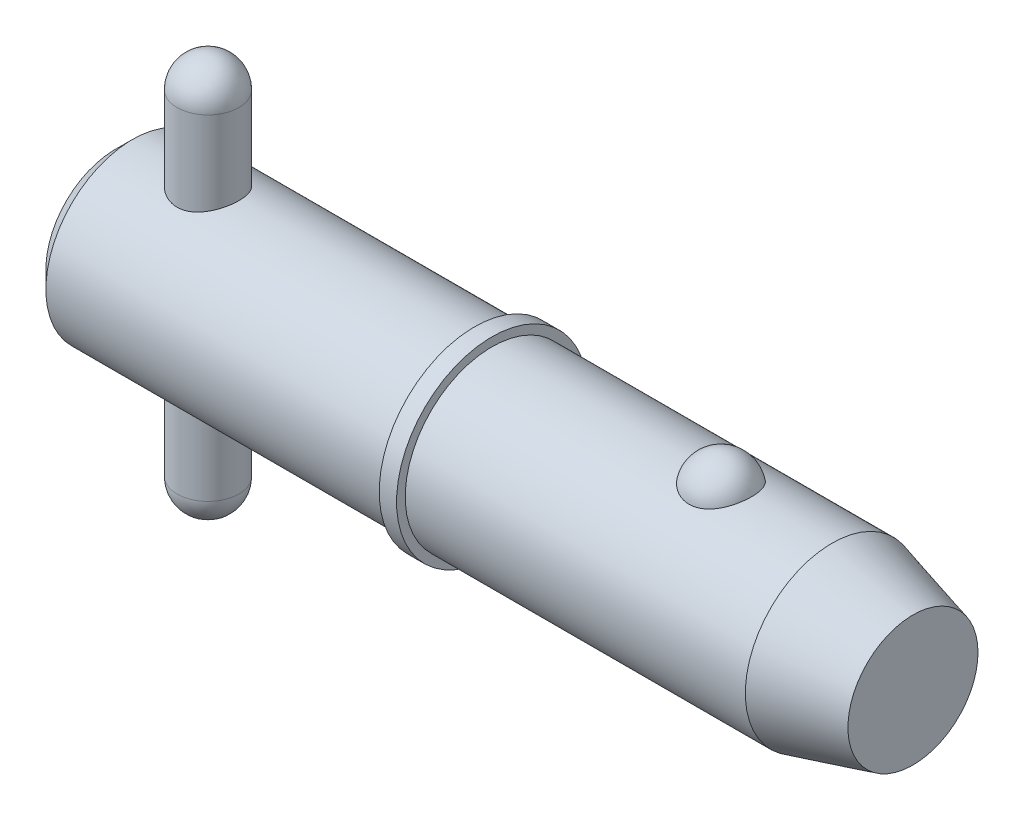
ISO-10303-21;
HEADER;
FILE_DESCRIPTION(('STEP AP214'),'2;1');
FILE_NAME('part.step','',(''),(''),'','','');
FILE_SCHEMA(('AUTOMOTIVE_DESIGN { 1 0 10303 214 1 1 1 1 }'));
ENDSEC;
DATA;
#1=APPLICATION_CONTEXT('core data for automotive mechanical design processes');
#2=APPLICATION_PROTOCOL_DEFINITION('international standard','automotive_design',2000,#1);
#3=PRODUCT_CONTEXT('',#1,'mechanical');
#4=PRODUCT('Part','Part','',(#3));
#5=PRODUCT_RELATED_PRODUCT_CATEGORY('part','',(#4));
#6=PRODUCT_DEFINITION_FORMATION('','',#4);
#7=PRODUCT_DEFINITION_CONTEXT('part definition',#1,'design');
#8=PRODUCT_DEFINITION('design','',#6,#7);
#9=PRODUCT_DEFINITION_SHAPE('','',#8);
#10=(LENGTH_UNIT() NAMED_UNIT(*) SI_UNIT(.MILLI.,.METRE.));
#11=(NAMED_UNIT(*) PLANE_ANGLE_UNIT() SI_UNIT($,.RADIAN.));
#12=(NAMED_UNIT(*) SI_UNIT($,.STERADIAN.) SOLID_ANGLE_UNIT());
#13=UNCERTAINTY_MEASURE_WITH_UNIT(LENGTH_MEASURE(1.E-05),#10,'distance_accuracy_value','');
#14=(GEOMETRIC_REPRESENTATION_CONTEXT(3) GLOBAL_UNCERTAINTY_ASSIGNED_CONTEXT((#13)) GLOBAL_UNIT_ASSIGNED_CONTEXT((#10,
#11,#12)) REPRESENTATION_CONTEXT('',''));
#15=CARTESIAN_POINT('',(0.,0.,0.));
#16=DIRECTION('',(0.,0.,1.));
#17=DIRECTION('',(1.,0.,0.));
#18=AXIS2_PLACEMENT_3D('',#15,#16,#17);
#19=CARTESIAN_POINT('',(5.94,12.7,0.));
#20=DIRECTION('',(0.,-1.,0.));
#21=DIRECTION('',(0.,0.,-1.));
#22=AXIS2_PLACEMENT_3D('',#19,#20,#21);
#23=CYLINDRICAL_SURFACE('',#22,1.98);
#24=CARTESIAN_POINT('',(5.94,-10.72,0.));
#25=DIRECTION('',(0.,-1.,0.));
#26=DIRECTION('',(0.,0.,-1.));
#27=AXIS2_PLACEMENT_3D('',#24,#25,#26);
#28=CIRCLE('',#27,1.98);
#29=CARTESIAN_POINT('',(5.94,-10.72,-1.98));
#30=VERTEX_POINT('',#29);
#31=EDGE_CURVE('P0_E10',#30,#30,#28,.F.);
#32=ORIENTED_EDGE('',*,*,#31,.T.);
#33=EDGE_LOOP('',(#32));
#34=FACE_BOUND('',#33,.T.);
#35=CARTESIAN_POINT('',(5.94,10.72,0.));
#36=DIRECTION('',(0.,-1.,0.));
#37=DIRECTION('',(0.,0.,-1.));
#38=AXIS2_PLACEMENT_3D('',#35,#36,#37);
#39=CIRCLE('',#38,1.98);
#40=CARTESIAN_POINT('',(5.94,10.72,-1.98));
#41=VERTEX_POINT('',#40);
#42=EDGE_CURVE('P0_E21',#41,#41,#39,.T.);
#43=ORIENTED_EDGE('',*,*,#42,.T.);
#44=EDGE_LOOP('',(#43));
#45=FACE_BOUND('',#44,.T.);
#46=ADVANCED_FACE('P0_F14',(#34,#45),#23,.T.);
#47=CARTESIAN_POINT('',(5.94,-10.72,0.));
#48=DIRECTION('',(0.,0.,1.));
#49=DIRECTION('',(1.,0.,0.));
#50=AXIS2_PLACEMENT_3D('',#47,#48,#49);
#51=SPHERICAL_SURFACE('',#50,1.98);
#52=CARTESIAN_POINT('',(5.94,-10.72,0.));
#53=DIRECTION('',(0.,-1.,0.));
#54=DIRECTION('',(0.,0.,-1.));
#55=AXIS2_PLACEMENT_3D('',#52,#53,#54);
#56=SPHERICAL_SURFACE('',#55,1.98);
#57=ORIENTED_EDGE('',*,*,#31,.F.);
#58=EDGE_LOOP('',(#57));
#59=FACE_BOUND('',#58,.T.);
#60=ADVANCED_FACE('P0_F29',(#59),#56,.T.);
#61=CARTESIAN_POINT('',(5.94,10.72,0.));
#62=DIRECTION('',(0.,0.,1.));
#63=DIRECTION('',(1.,0.,0.));
#64=AXIS2_PLACEMENT_3D('',#61,#62,#63);
#65=SPHERICAL_SURFACE('',#64,1.98);
#66=CARTESIAN_POINT('',(5.94,10.72,0.));
#67=DIRECTION('',(0.,-1.,0.));
#68=DIRECTION('',(0.,0.,-1.));
#69=AXIS2_PLACEMENT_3D('',#66,#67,#68);
#70=SPHERICAL_SURFACE('',#69,1.98);
#71=ORIENTED_EDGE('',*,*,#42,.F.);
#72=EDGE_LOOP('',(#71));
#73=FACE_BOUND('',#72,.T.);
#74=ADVANCED_FACE('P0_F16',(#73),#70,.T.);
#75=CLOSED_SHELL('',(#46,#60,#74));
#76=MANIFOLD_SOLID_BREP('P0_B1',#75);
#77=CARTESIAN_POINT('',(0.,0.,0.));
#78=DIRECTION('',(1.,0.,0.));
#79=DIRECTION('',(0.,0.,-1.));
#80=AXIS2_PLACEMENT_3D('',#77,#78,#79);
#81=CYLINDRICAL_SURFACE('',#80,5.555);
#82=CARTESIAN_POINT('',(45.9171144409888,0.,0.));
#83=DIRECTION('',(1.,0.,0.));
#84=DIRECTION('',(0.,0.,-1.));
#85=AXIS2_PLACEMENT_3D('',#82,#83,#84);
#86=CIRCLE('',#85,5.555);
#87=CARTESIAN_POINT('',(45.9171144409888,0.,-5.555));
#88=VERTEX_POINT('',#87);
#89=EDGE_CURVE('P1_E81',#88,#88,#86,.T.);
#90=ORIENTED_EDGE('',*,*,#89,.F.);
#91=EDGE_LOOP('',(#90));
#92=FACE_BOUND('',#91,.T.);
#93=CARTESIAN_POINT('',(24.13,0.,0.));
#94=DIRECTION('',(1.,0.,0.));
#95=DIRECTION('',(0.,0.,-1.));
#96=AXIS2_PLACEMENT_3D('',#93,#94,#95);
#97=CIRCLE('',#96,5.555);
#98=CARTESIAN_POINT('',(24.13,0.,-5.555));
#99=VERTEX_POINT('',#98);
#100=EDGE_CURVE('P1_E85',#99,#99,#97,.T.);
#101=ORIENTED_EDGE('',*,*,#100,.T.);
#102=EDGE_LOOP('',(#101));
#103=FACE_BOUND('',#102,.T.);
#104=CARTESIAN_POINT('',(38.7986264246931,5.16741224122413,2.03859650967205));
#105=CARTESIAN_POINT('',(38.6929492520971,5.16740893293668,2.03859990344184));
#106=CARTESIAN_POINT('',(38.58729894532,5.17079470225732,2.03008306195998));
#107=CARTESIAN_POINT('',(38.3791419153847,5.18392795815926,1.9963072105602));
#108=CARTESIAN_POINT('',(38.2766344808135,5.19367399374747,1.9710520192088));
#109=CARTESIAN_POINT('',(38.0777710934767,5.21839168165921,1.90463997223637));
#110=CARTESIAN_POINT('',(37.9814064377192,5.23335573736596,1.86350622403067));
#111=CARTESIAN_POINT('',(37.7970804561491,5.26688076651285,1.76652592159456));
#112=CARTESIAN_POINT('',(37.7091207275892,5.28544242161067,1.71067657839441));
#113=CARTESIAN_POINT('',(37.5412654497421,5.32479845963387,1.58399959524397));
#114=CARTESIAN_POINT('',(37.4616656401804,5.34564089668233,1.51279545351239));
#115=CARTESIAN_POINT('',(37.3151290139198,5.38697258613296,1.35828584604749));
#116=CARTESIAN_POINT('',(37.248194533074,5.40746177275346,1.27497815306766));
#117=CARTESIAN_POINT('',(37.1256103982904,5.44694508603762,1.09440293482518));
#118=CARTESIAN_POINT('',(37.0705989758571,5.46583143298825,0.99667783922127));
#119=CARTESIAN_POINT('',(36.9769376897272,5.49908030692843,0.792961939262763));
#120=CARTESIAN_POINT('',(36.9382894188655,5.513442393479,0.686970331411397));
#121=CARTESIAN_POINT('',(36.8776807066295,5.536358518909,0.468019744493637));
#122=CARTESIAN_POINT('',(36.8559725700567,5.54482455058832,0.35498154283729));
#123=CARTESIAN_POINT('',(36.8306362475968,5.55473324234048,0.126595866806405));
#124=CARTESIAN_POINT('',(36.8270077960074,5.55617600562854,0.0112484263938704));
#125=CARTESIAN_POINT('',(36.8378817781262,5.55189984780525,-0.21801161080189));
#126=CARTESIAN_POINT('',(36.8523151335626,5.54620821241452,-0.331928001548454));
#127=CARTESIAN_POINT('',(36.898903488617,5.52828920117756,-0.555544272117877));
#128=CARTESIAN_POINT('',(36.9310588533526,5.5160616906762,-0.665244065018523));
#129=CARTESIAN_POINT('',(37.0124883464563,5.48630779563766,-0.877469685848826));
#130=CARTESIAN_POINT('',(37.0617816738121,5.4687754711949,-0.979987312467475));
#131=CARTESIAN_POINT('',(37.1764785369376,5.43024700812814,-1.1748697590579));
#132=CARTESIAN_POINT('',(37.2418831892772,5.4092506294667,-1.26723387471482));
#133=CARTESIAN_POINT('',(37.3875712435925,5.36600927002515,-1.4394013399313));
#134=CARTESIAN_POINT('',(37.4678859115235,5.34376173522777,-1.51917763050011));
#135=CARTESIAN_POINT('',(37.6414520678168,5.30057971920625,-1.6636033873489));
#136=CARTESIAN_POINT('',(37.734702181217,5.27964509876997,-1.72825445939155));
#137=CARTESIAN_POINT('',(37.9293939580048,5.24205250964,-1.8390947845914));
#138=CARTESIAN_POINT('',(38.0305900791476,5.22530519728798,-1.88568407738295));
#139=CARTESIAN_POINT('',(38.2401552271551,5.19750919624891,-1.96100802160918));
#140=CARTESIAN_POINT('',(38.3485215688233,5.1864583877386,-1.98974931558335));
#141=CARTESIAN_POINT('',(38.5634989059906,5.17184410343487,-2.02742262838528));
#142=CARTESIAN_POINT('',(38.669925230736,5.16793282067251,-2.0372760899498));
#143=CARTESIAN_POINT('',(38.8829925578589,5.1669899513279,-2.03966777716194));
#144=CARTESIAN_POINT('',(38.9896335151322,5.16995704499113,-2.03220932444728));
#145=CARTESIAN_POINT('',(39.1967730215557,5.18222383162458,-2.0007117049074));
#146=CARTESIAN_POINT('',(39.2973599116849,5.19133213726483,-1.97717337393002));
#147=CARTESIAN_POINT('',(39.4930141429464,5.21467637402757,-1.91475248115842));
#148=CARTESIAN_POINT('',(39.5880810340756,5.22891272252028,-1.87586867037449));
#149=CARTESIAN_POINT('',(39.7723711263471,5.26137066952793,-1.78282713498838));
#150=CARTESIAN_POINT('',(39.8614190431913,5.27967329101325,-1.7283512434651));
#151=CARTESIAN_POINT('',(40.0292880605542,5.31817411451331,-1.60597483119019));
#152=CARTESIAN_POINT('',(40.1081068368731,5.33837274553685,-1.53807126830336));
#153=CARTESIAN_POINT('',(40.2575156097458,5.37968287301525,-1.38688970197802));
#154=CARTESIAN_POINT('',(40.3275058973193,5.40079011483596,-1.30301744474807));
#155=CARTESIAN_POINT('',(40.4530125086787,5.44074401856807,-1.12458170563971));
#156=CARTESIAN_POINT('',(40.5085262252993,5.4595902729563,-1.03001630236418));
#157=CARTESIAN_POINT('',(40.6055507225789,5.49369849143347,-0.829439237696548));
#158=CARTESIAN_POINT('',(40.6465483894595,5.50882422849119,-0.723155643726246));
#159=CARTESIAN_POINT('',(40.7111250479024,5.53310911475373,-0.50477271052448));
#160=CARTESIAN_POINT('',(40.7347036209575,5.54226812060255,-0.3926732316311));
#161=CARTESIAN_POINT('',(40.764013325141,5.55370358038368,-0.165459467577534));
#162=CARTESIAN_POINT('',(40.7696884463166,5.55595843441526,-0.0503368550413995));
#163=CARTESIAN_POINT('',(40.762916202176,5.55329317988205,0.179288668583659));
#164=CARTESIAN_POINT('',(40.7504690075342,5.54837313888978,0.293791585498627));
#165=CARTESIAN_POINT('',(40.7077798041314,5.53189037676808,0.518526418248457));
#166=CARTESIAN_POINT('',(40.677598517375,5.5203503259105,0.628771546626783));
#167=CARTESIAN_POINT('',(40.6000962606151,5.49182453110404,0.842318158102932));
#168=CARTESIAN_POINT('',(40.5527743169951,5.47483847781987,0.945619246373));
#169=CARTESIAN_POINT('',(40.4417204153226,5.43710633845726,1.14281571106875));
#170=CARTESIAN_POINT('',(40.3779215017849,5.41634501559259,1.23667048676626));
#171=CARTESIAN_POINT('',(40.2353577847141,5.37334572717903,1.4118524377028));
#172=CARTESIAN_POINT('',(40.1565932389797,5.35110778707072,1.49317982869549));
#173=CARTESIAN_POINT('',(39.9864234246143,5.30779474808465,1.64049162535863));
#174=CARTESIAN_POINT('',(39.8951002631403,5.28671324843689,1.7065687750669));
#175=CARTESIAN_POINT('',(39.7017390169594,5.24804852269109,1.82201372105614));
#176=CARTESIAN_POINT('',(39.5997005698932,5.23046541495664,1.87138095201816));
#177=CARTESIAN_POINT('',(39.3836187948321,5.20042692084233,1.95335298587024));
#178=CARTESIAN_POINT('',(39.269260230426,5.18820192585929,1.98521734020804));
#179=CARTESIAN_POINT('',(39.0361307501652,5.17169804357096,2.02783294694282));
#180=CARTESIAN_POINT('',(38.9173616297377,5.16741595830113,2.03859269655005));
#181=CARTESIAN_POINT('',(38.7986264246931,5.16741224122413,2.03859650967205));
#182=B_SPLINE_CURVE_WITH_KNOTS('',3,(#104,#105,#106,#107,#108,#109,#110,#111,#112,#113,#114,
#115,#116,#117,#118,#119,#120,#121,#122,#123,#124,#125,#126,#127,#128,#129,#130,#131,#132,#133,
#134,#135,#136,#137,#138,#139,#140,#141,#142,#143,#144,#145,#146,#147,#148,#149,#150,#151,#152,
#153,#154,#155,#156,#157,#158,#159,#160,#161,#162,#163,#164,#165,#166,#167,#168,#169,#170,#171,
#172,#173,#174,#175,#176,#177,#178,#179,#180,#181),.UNSPECIFIED.,.T.,.F.,(4,2,2,2,2,2,2,2,2,2,2,
2,2,2,2,2,2,2,2,2,2,2,2,2,2,2,2,2,2,2,2,2,2,2,2,2,2,2,4),(0.,0.316595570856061,
0.633118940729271,0.949183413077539,1.26530783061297,1.59030762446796,1.91536729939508,
2.25495824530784,2.59458224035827,2.93917283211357,3.28375835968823,3.62703002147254,
3.97030875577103,4.31397329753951,4.65766166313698,5.00207904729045,5.34645984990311,
5.6827054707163,6.01882587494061,6.33808403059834,6.65728093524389,6.9669637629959,
7.27667180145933,7.59321535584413,7.90983070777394,8.24210387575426,8.57443684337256,
8.91755896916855,9.26068933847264,9.60489211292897,9.94909164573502,10.2921194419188,
10.6351667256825,10.9796305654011,11.324088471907,11.666392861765,12.0087088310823,
12.3645679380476,12.7202837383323),.UNSPECIFIED.);
#183=CARTESIAN_POINT('',(38.7986264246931,5.16741224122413,2.03859650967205));
#184=VERTEX_POINT('',#183);
#185=EDGE_CURVE('P1_E35',#184,#184,#182,.T.);
#186=ORIENTED_EDGE('',*,*,#185,.T.);
#187=EDGE_LOOP('',(#186));
#188=FACE_BOUND('',#187,.T.);
#189=ADVANCED_FACE('P1_F13',(#92,#103,#188),#81,.T.);
#190=CARTESIAN_POINT('',(0.,0.,0.));
#191=DIRECTION('',(-1.,0.,0.));
#192=DIRECTION('',(0.,0.,1.));
#193=AXIS2_PLACEMENT_3D('',#190,#191,#192);
#194=PLANE('',#193);
#195=CARTESIAN_POINT('',(0.,0.,0.));
#196=DIRECTION('',(1.,0.,0.));
#197=DIRECTION('',(0.,0.,-1.));
#198=AXIS2_PLACEMENT_3D('',#195,#196,#197);
#199=CIRCLE('',#198,4.444);
#200=CARTESIAN_POINT('',(0.,0.,-4.444));
#201=VERTEX_POINT('',#200);
#202=EDGE_CURVE('P1_E9',#201,#201,#199,.T.);
#203=ORIENTED_EDGE('',*,*,#202,.F.);
#204=EDGE_LOOP('',(#203));
#205=FACE_BOUND('',#204,.T.);
#206=ADVANCED_FACE('P1_F15',(#205),#194,.T.);
#207=CARTESIAN_POINT('',(1.111,0.,0.));
#208=DIRECTION('',(1.,0.,0.));
#209=DIRECTION('',(0.,0.,-1.));
#210=AXIS2_PLACEMENT_3D('',#207,#208,#209);
#211=CONICAL_SURFACE('',#210,5.555,0.78539816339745);
#212=ORIENTED_EDGE('',*,*,#202,.T.);
#213=EDGE_LOOP('',(#212));
#214=FACE_BOUND('',#213,.T.);
#215=CARTESIAN_POINT('',(1.111,0.,0.));
#216=DIRECTION('',(1.,0.,0.));
#217=DIRECTION('',(0.,0.,-1.));
#218=AXIS2_PLACEMENT_3D('',#215,#216,#217);
#219=CIRCLE('',#218,5.555);
#220=CARTESIAN_POINT('',(1.111,0.,-5.555));
#221=VERTEX_POINT('',#220);
#222=EDGE_CURVE('P1_E26',#221,#221,#219,.T.);
#223=ORIENTED_EDGE('',*,*,#222,.F.);
#224=EDGE_LOOP('',(#223));
#225=FACE_BOUND('',#224,.T.);
#226=ADVANCED_FACE('P1_F77',(#214,#225),#211,.T.);
#227=CARTESIAN_POINT('',(0.,0.,0.));
#228=DIRECTION('',(1.,0.,0.));
#229=DIRECTION('',(0.,0.,-1.));
#230=AXIS2_PLACEMENT_3D('',#227,#228,#229);
#231=CYLINDRICAL_SURFACE('',#230,5.555);
#232=CARTESIAN_POINT('',(5.94,-5.19014691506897,1.98));
#233=CARTESIAN_POINT('',(5.83264687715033,-5.19014494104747,1.98000226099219));
#234=CARTESIAN_POINT('',(5.7253094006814,-5.19351395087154,1.97123988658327));
#235=CARTESIAN_POINT('',(5.51384517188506,-5.20654291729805,1.93656219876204));
#236=CARTESIAN_POINT('',(5.40971858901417,-5.21620320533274,1.91064598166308));
#237=CARTESIAN_POINT('',(5.20778082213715,-5.24058443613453,1.84271148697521));
#238=CARTESIAN_POINT('',(5.10995634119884,-5.25529427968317,1.80072850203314));
#239=CARTESIAN_POINT('',(4.92270352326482,-5.28810012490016,1.70197537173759));
#240=CARTESIAN_POINT('',(4.83327743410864,-5.3061970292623,1.64520128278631));
#241=CARTESIAN_POINT('',(4.66135184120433,-5.34464714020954,1.51575187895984));
#242=CARTESIAN_POINT('',(4.57928277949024,-5.36506222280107,1.44252311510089));
#243=CARTESIAN_POINT('',(4.42829115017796,-5.40532920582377,1.28342047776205));
#244=CARTESIAN_POINT('',(4.35937105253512,-5.42518099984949,1.19754423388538));
#245=CARTESIAN_POINT('',(4.23461605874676,-5.46281133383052,1.01237205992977));
#246=CARTESIAN_POINT('',(4.17924129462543,-5.48050875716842,0.912748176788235));
#247=CARTESIAN_POINT('',(4.0862117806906,-5.51109938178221,0.70485824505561));
#248=CARTESIAN_POINT('',(4.0485515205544,-5.52399407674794,0.596594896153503));
#249=CARTESIAN_POINT('',(3.99350662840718,-5.54308759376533,0.379019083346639));
#250=CARTESIAN_POINT('',(3.97538263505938,-5.54952987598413,0.269915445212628));
#251=CARTESIAN_POINT('',(3.95756405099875,-5.55586205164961,0.0500378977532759));
#252=CARTESIAN_POINT('',(3.95786404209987,-5.55575387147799,-0.060735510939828));
#253=CARTESIAN_POINT('',(3.97643665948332,-5.54915684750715,-0.275539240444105));
#254=CARTESIAN_POINT('',(3.99390415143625,-5.54295384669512,-0.379649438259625));
#255=CARTESIAN_POINT('',(4.0449721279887,-5.52523170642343,-0.583350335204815));
#256=CARTESIAN_POINT('',(4.07857373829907,-5.51371219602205,-0.682940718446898));
#257=CARTESIAN_POINT('',(4.16137312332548,-5.4863099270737,-0.876423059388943));
#258=CARTESIAN_POINT('',(4.2107826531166,-5.47036834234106,-0.970215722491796));
#259=CARTESIAN_POINT('',(4.32361427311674,-5.43575653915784,-1.1484017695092));
#260=CARTESIAN_POINT('',(4.38704062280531,-5.41708549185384,-1.23279228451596));
#261=CARTESIAN_POINT('',(4.53006791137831,-5.37778429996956,-1.39454579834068));
#262=CARTESIAN_POINT('',(4.61035105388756,-5.35710277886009,-1.4712940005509));
#263=CARTESIAN_POINT('',(4.78279835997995,-5.31692766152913,-1.6104545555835));
#264=CARTESIAN_POINT('',(4.874964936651,-5.29743430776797,-1.67286398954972));
#265=CARTESIAN_POINT('',(5.07076688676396,-5.26153775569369,-1.78259698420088));
#266=CARTESIAN_POINT('',(5.17458163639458,-5.24519780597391,-1.8296227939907));
#267=CARTESIAN_POINT('',(5.38938990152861,-5.21818744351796,-1.90530278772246));
#268=CARTESIAN_POINT('',(5.50037985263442,-5.20751423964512,-1.93396601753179));
#269=CARTESIAN_POINT('',(5.72036376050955,-5.19369176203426,-1.97077654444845));
#270=CARTESIAN_POINT('',(5.82917370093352,-5.19018851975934,-1.97989015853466));
#271=CARTESIAN_POINT('',(6.04680100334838,-5.19010609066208,-1.98010779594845));
#272=CARTESIAN_POINT('',(6.15561835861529,-5.19352540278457,-1.97121572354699));
#273=CARTESIAN_POINT('',(6.36548036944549,-5.20654623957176,-1.93654727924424));
#274=CARTESIAN_POINT('',(6.46666051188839,-5.21588705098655,-1.91148218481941));
#275=CARTESIAN_POINT('',(6.66334537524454,-5.23939939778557,-1.84605494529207));
#276=CARTESIAN_POINT('',(6.75884899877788,-5.25357186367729,-1.8056898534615));
#277=CARTESIAN_POINT('',(6.94517989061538,-5.28576258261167,-1.70921153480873));
#278=CARTESIAN_POINT('',(7.03572661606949,-5.30389804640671,-1.65259670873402));
#279=CARTESIAN_POINT('',(7.20638087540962,-5.34176077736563,-1.52577523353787));
#280=CARTESIAN_POINT('',(7.28648490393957,-5.36148857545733,-1.45556404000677));
#281=CARTESIAN_POINT('',(7.43864697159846,-5.40165494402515,-1.2988614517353));
#282=CARTESIAN_POINT('',(7.50999887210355,-5.42207106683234,-1.21167640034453));
#283=CARTESIAN_POINT('',(7.63712639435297,-5.46023601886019,-1.026066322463));
#284=CARTESIAN_POINT('',(7.69290228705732,-5.47798489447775,-0.927641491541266));
#285=CARTESIAN_POINT('',(7.78684673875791,-5.50876590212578,-0.722633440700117));
#286=CARTESIAN_POINT('',(7.82510508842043,-5.52182201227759,-0.616095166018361));
#287=CARTESIAN_POINT('',(7.88297051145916,-5.54184206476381,-0.397530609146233));
#288=CARTESIAN_POINT('',(7.90258540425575,-5.5488085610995,-0.285506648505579));
#289=CARTESIAN_POINT('',(7.9218262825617,-5.55564472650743,-0.065566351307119));
#290=CARTESIAN_POINT('',(7.92245987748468,-5.55587212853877,0.0422515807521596));
#291=CARTESIAN_POINT('',(7.90626329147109,-5.55011340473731,0.256387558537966));
#292=CARTESIAN_POINT('',(7.88943488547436,-5.54412791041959,0.362705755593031));
#293=CARTESIAN_POINT('',(7.83948457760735,-5.52676548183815,0.568649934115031));
#294=CARTESIAN_POINT('',(7.8067003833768,-5.51550046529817,0.668367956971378));
#295=CARTESIAN_POINT('',(7.72609369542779,-5.48874437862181,0.860911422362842));
#296=CARTESIAN_POINT('',(7.67826838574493,-5.47325251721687,0.953735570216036));
#297=CARTESIAN_POINT('',(7.56675024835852,-5.43884382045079,1.13391068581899));
#298=CARTESIAN_POINT('',(7.50249968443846,-5.41981485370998,1.22089468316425));
#299=CARTESIAN_POINT('',(7.36086495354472,-5.38069275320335,1.38316665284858));
#300=CARTESIAN_POINT('',(7.28347630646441,-5.36059925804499,1.45845061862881));
#301=CARTESIAN_POINT('',(7.11347587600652,-5.32048380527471,1.59876646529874));
#302=CARTESIAN_POINT('',(7.02032386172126,-5.30050854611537,1.66315951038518));
#303=CARTESIAN_POINT('',(6.82388804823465,-5.26398994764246,1.77536801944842));
#304=CARTESIAN_POINT('',(6.7206049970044,-5.24744635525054,1.82318470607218));
#305=CARTESIAN_POINT('',(6.50639706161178,-5.21987969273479,1.90068230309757));
#306=CARTESIAN_POINT('',(6.3954529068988,-5.20887116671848,1.93031547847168));
#307=CARTESIAN_POINT('',(6.16966522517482,-5.19400760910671,1.96996824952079));
#308=CARTESIAN_POINT('',(6.05482366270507,-5.19014902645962,1.97999758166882));
#309=CARTESIAN_POINT('',(5.94,-5.19014691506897,1.98));
#310=B_SPLINE_CURVE_WITH_KNOTS('',3,(#232,#233,#234,#235,#236,#237,#238,#239,#240,#241,#242,
#243,#244,#245,#246,#247,#248,#249,#250,#251,#252,#253,#254,#255,#256,#257,#258,#259,#260,#261,
#262,#263,#264,#265,#266,#267,#268,#269,#270,#271,#272,#273,#274,#275,#276,#277,#278,#279,#280,
#281,#282,#283,#284,#285,#286,#287,#288,#289,#290,#291,#292,#293,#294,#295,#296,#297,#298,#299,
#300,#301,#302,#303,#304,#305,#306,#307,#308,#309),.UNSPECIFIED.,.T.,.F.,(4,2,2,2,2,2,2,2,2,2,2,
2,2,2,2,2,2,2,2,2,2,2,2,2,2,2,2,2,2,2,2,2,2,2,2,2,2,2,4),(0.,0.321632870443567,
0.643282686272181,0.964229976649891,1.28526292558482,1.61937087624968,1.9535415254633,
2.29784481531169,2.64204093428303,2.97269632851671,3.30325448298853,3.61901541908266,
3.93479838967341,4.25500220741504,4.57530346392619,4.91268648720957,5.25013812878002,
5.59378026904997,5.93725299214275,6.26331481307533,6.58930593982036,6.90185604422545,
7.21446637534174,7.53801472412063,7.86167140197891,8.20353561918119,8.54539388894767,
8.88547970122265,9.22542281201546,9.54728637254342,9.86911722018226,10.1844146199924,
10.4997710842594,10.827730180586,11.1558013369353,11.499115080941,11.8424034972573,
12.1865892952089,12.5306041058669),.UNSPECIFIED.);
#311=CARTESIAN_POINT('',(5.94,-5.19014691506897,1.98));
#312=VERTEX_POINT('',#311);
#313=EDGE_CURVE('P1_E17',#312,#312,#310,.T.);
#314=ORIENTED_EDGE('',*,*,#313,.F.);
#315=EDGE_LOOP('',(#314));
#316=FACE_BOUND('',#315,.T.);
#317=CARTESIAN_POINT('',(5.94,5.19014691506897,1.98));
#318=CARTESIAN_POINT('',(6.04735312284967,5.19014494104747,1.98000226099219));
#319=CARTESIAN_POINT('',(6.1546905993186,5.19351395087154,1.97123988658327));
#320=CARTESIAN_POINT('',(6.36615482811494,5.20654291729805,1.93656219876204));
#321=CARTESIAN_POINT('',(6.47028141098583,5.21620320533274,1.91064598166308));
#322=CARTESIAN_POINT('',(6.67221917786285,5.24058443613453,1.84271148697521));
#323=CARTESIAN_POINT('',(6.77004365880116,5.25529427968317,1.80072850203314));
#324=CARTESIAN_POINT('',(6.95729647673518,5.28810012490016,1.70197537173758));
#325=CARTESIAN_POINT('',(7.04672256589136,5.3061970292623,1.64520128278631));
#326=CARTESIAN_POINT('',(7.21864815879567,5.34464714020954,1.51575187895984));
#327=CARTESIAN_POINT('',(7.30071722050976,5.36506222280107,1.44252311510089));
#328=CARTESIAN_POINT('',(7.45170884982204,5.40532920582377,1.28342047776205));
#329=CARTESIAN_POINT('',(7.52062894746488,5.42518099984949,1.19754423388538));
#330=CARTESIAN_POINT('',(7.64538394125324,5.46281133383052,1.01237205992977));
#331=CARTESIAN_POINT('',(7.70075870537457,5.48050875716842,0.912748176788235));
#332=CARTESIAN_POINT('',(7.7937882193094,5.51109938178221,0.704858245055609));
#333=CARTESIAN_POINT('',(7.8314484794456,5.52399407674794,0.596594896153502));
#334=CARTESIAN_POINT('',(7.88649337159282,5.54308759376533,0.379019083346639));
#335=CARTESIAN_POINT('',(7.90461736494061,5.54952987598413,0.269915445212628));
#336=CARTESIAN_POINT('',(7.92243594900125,5.55586205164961,0.0500378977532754));
#337=CARTESIAN_POINT('',(7.92213595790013,5.55575387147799,-0.0607355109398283));
#338=CARTESIAN_POINT('',(7.90356334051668,5.54915684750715,-0.275539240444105));
#339=CARTESIAN_POINT('',(7.88609584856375,5.54295384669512,-0.379649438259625));
#340=CARTESIAN_POINT('',(7.8350278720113,5.52523170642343,-0.583350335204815));
#341=CARTESIAN_POINT('',(7.80142626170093,5.51371219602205,-0.682940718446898));
#342=CARTESIAN_POINT('',(7.71862687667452,5.4863099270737,-0.876423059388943));
#343=CARTESIAN_POINT('',(7.6692173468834,5.47036834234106,-0.970215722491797));
#344=CARTESIAN_POINT('',(7.55638572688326,5.43575653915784,-1.1484017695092));
#345=CARTESIAN_POINT('',(7.49295937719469,5.41708549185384,-1.23279228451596));
#346=CARTESIAN_POINT('',(7.34993208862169,5.37778429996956,-1.39454579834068));
#347=CARTESIAN_POINT('',(7.26964894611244,5.35710277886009,-1.4712940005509));
#348=CARTESIAN_POINT('',(7.09720164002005,5.31692766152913,-1.6104545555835));
#349=CARTESIAN_POINT('',(7.00503506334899,5.29743430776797,-1.67286398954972));
#350=CARTESIAN_POINT('',(6.80923311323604,5.26153775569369,-1.78259698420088));
#351=CARTESIAN_POINT('',(6.70541836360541,5.24519780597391,-1.8296227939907));
#352=CARTESIAN_POINT('',(6.49061009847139,5.21818744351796,-1.90530278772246));
#353=CARTESIAN_POINT('',(6.37962014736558,5.20751423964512,-1.93396601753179));
#354=CARTESIAN_POINT('',(6.15963623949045,5.19369176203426,-1.97077654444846));
#355=CARTESIAN_POINT('',(6.05082629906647,5.19018851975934,-1.97989015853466));
#356=CARTESIAN_POINT('',(5.83319899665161,5.19010609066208,-1.98010779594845));
#357=CARTESIAN_POINT('',(5.7243816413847,5.19352540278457,-1.97121572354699));
#358=CARTESIAN_POINT('',(5.5145196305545,5.20654623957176,-1.93654727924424));
#359=CARTESIAN_POINT('',(5.4133394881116,5.21588705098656,-1.91148218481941));
#360=CARTESIAN_POINT('',(5.21665462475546,5.23939939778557,-1.84605494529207));
#361=CARTESIAN_POINT('',(5.12115100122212,5.25357186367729,-1.8056898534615));
#362=CARTESIAN_POINT('',(4.93482010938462,5.28576258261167,-1.70921153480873));
#363=CARTESIAN_POINT('',(4.84427338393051,5.30389804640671,-1.65259670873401));
#364=CARTESIAN_POINT('',(4.67361912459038,5.34176077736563,-1.52577523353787));
#365=CARTESIAN_POINT('',(4.59351509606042,5.36148857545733,-1.45556404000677));
#366=CARTESIAN_POINT('',(4.44135302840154,5.40165494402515,-1.2988614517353));
#367=CARTESIAN_POINT('',(4.37000112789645,5.42207106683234,-1.21167640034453));
#368=CARTESIAN_POINT('',(4.24287360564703,5.46023601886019,-1.026066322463));
#369=CARTESIAN_POINT('',(4.18709771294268,5.47798489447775,-0.927641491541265));
#370=CARTESIAN_POINT('',(4.09315326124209,5.50876590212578,-0.722633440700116));
#371=CARTESIAN_POINT('',(4.05489491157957,5.52182201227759,-0.61609516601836));
#372=CARTESIAN_POINT('',(3.99702948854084,5.54184206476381,-0.397530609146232));
#373=CARTESIAN_POINT('',(3.97741459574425,5.5488085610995,-0.285506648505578));
#374=CARTESIAN_POINT('',(3.9581737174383,5.55564472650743,-0.0655663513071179));
#375=CARTESIAN_POINT('',(3.95754012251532,5.55587212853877,0.0422515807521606));
#376=CARTESIAN_POINT('',(3.97373670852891,5.55011340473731,0.256387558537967));
#377=CARTESIAN_POINT('',(3.99056511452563,5.54412791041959,0.362705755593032));
#378=CARTESIAN_POINT('',(4.04051542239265,5.52676548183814,0.568649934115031));
#379=CARTESIAN_POINT('',(4.07329961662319,5.51550046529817,0.668367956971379));
#380=CARTESIAN_POINT('',(4.15390630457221,5.48874437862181,0.860911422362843));
#381=CARTESIAN_POINT('',(4.20173161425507,5.47325251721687,0.953735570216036));
#382=CARTESIAN_POINT('',(4.31324975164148,5.43884382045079,1.13391068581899));
#383=CARTESIAN_POINT('',(4.37750031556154,5.41981485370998,1.22089468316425));
#384=CARTESIAN_POINT('',(4.51913504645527,5.38069275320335,1.38316665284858));
#385=CARTESIAN_POINT('',(4.59652369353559,5.36059925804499,1.45845061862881));
#386=CARTESIAN_POINT('',(4.76652412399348,5.32048380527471,1.59876646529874));
#387=CARTESIAN_POINT('',(4.85967613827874,5.30050854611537,1.66315951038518));
#388=CARTESIAN_POINT('',(5.05611195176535,5.26398994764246,1.77536801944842));
#389=CARTESIAN_POINT('',(5.1593950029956,5.24744635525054,1.82318470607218));
#390=CARTESIAN_POINT('',(5.37360293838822,5.21987969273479,1.90068230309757));
#391=CARTESIAN_POINT('',(5.4845470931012,5.20887116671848,1.93031547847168));
#392=CARTESIAN_POINT('',(5.71033477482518,5.19400760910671,1.96996824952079));
#393=CARTESIAN_POINT('',(5.82517633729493,5.19014902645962,1.97999758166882));
#394=CARTESIAN_POINT('',(5.94,5.19014691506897,1.98));
#395=B_SPLINE_CURVE_WITH_KNOTS('',3,(#317,#318,#319,#320,#321,#322,#323,#324,#325,#326,#327,
#328,#329,#330,#331,#332,#333,#334,#335,#336,#337,#338,#339,#340,#341,#342,#343,#344,#345,#346,
#347,#348,#349,#350,#351,#352,#353,#354,#355,#356,#357,#358,#359,#360,#361,#362,#363,#364,#365,
#366,#367,#368,#369,#370,#371,#372,#373,#374,#375,#376,#377,#378,#379,#380,#381,#382,#383,#384,
#385,#386,#387,#388,#389,#390,#391,#392,#393,#394),.UNSPECIFIED.,.T.,.F.,(4,2,2,2,2,2,2,2,2,2,2,
2,2,2,2,2,2,2,2,2,2,2,2,2,2,2,2,2,2,2,2,2,2,2,2,2,2,2,4),(0.,0.321632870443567,
0.643282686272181,0.964229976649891,1.28526292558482,1.61937087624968,1.9535415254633,
2.29784481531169,2.64204093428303,2.97269632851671,3.30325448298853,3.61901541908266,
3.93479838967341,4.25500220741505,4.57530346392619,4.91268648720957,5.25013812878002,
5.59378026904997,5.93725299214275,6.26331481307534,6.58930593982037,6.90185604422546,
7.21446637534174,7.53801472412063,7.86167140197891,8.20353561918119,8.54539388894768,
8.88547970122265,9.22542281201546,9.54728637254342,9.86911722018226,10.1844146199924,
10.4997710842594,10.827730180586,11.1558013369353,11.499115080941,11.8424034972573,
12.1865892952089,12.5306041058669),.UNSPECIFIED.);
#396=CARTESIAN_POINT('',(5.94,5.19014691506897,1.98));
#397=VERTEX_POINT('',#396);
#398=EDGE_CURVE('P1_E43',#397,#397,#395,.T.);
#399=ORIENTED_EDGE('',*,*,#398,.F.);
#400=EDGE_LOOP('',(#399));
#401=FACE_BOUND('',#400,.T.);
#402=ORIENTED_EDGE('',*,*,#222,.T.);
#403=EDGE_LOOP('',(#402));
#404=FACE_BOUND('',#403,.T.);
#405=CARTESIAN_POINT('',(23.019,0.,0.));
#406=DIRECTION('',(1.,0.,0.));
#407=DIRECTION('',(0.,0.,-1.));
#408=AXIS2_PLACEMENT_3D('',#405,#406,#407);
#409=CIRCLE('',#408,5.555);
#410=CARTESIAN_POINT('',(23.019,0.,-5.555));
#411=VERTEX_POINT('',#410);
#412=EDGE_CURVE('P1_E31',#411,#411,#409,.T.);
#413=ORIENTED_EDGE('',*,*,#412,.F.);
#414=EDGE_LOOP('',(#413));
#415=FACE_BOUND('',#414,.T.);
#416=ADVANCED_FACE('P1_F103',(#316,#401,#404,#415),#231,.T.);
#417=CARTESIAN_POINT('',(23.019,5.555,0.));
#418=DIRECTION('',(-1.,0.,0.));
#419=DIRECTION('',(0.,0.,1.));
#420=AXIS2_PLACEMENT_3D('',#417,#418,#419);
#421=PLANE('',#420);
#422=ORIENTED_EDGE('',*,*,#412,.T.);
#423=EDGE_LOOP('',(#422));
#424=FACE_BOUND('',#423,.T.);
#425=CARTESIAN_POINT('',(23.019,0.,0.));
#426=DIRECTION('',(1.,0.,0.));
#427=DIRECTION('',(0.,0.,-1.));
#428=AXIS2_PLACEMENT_3D('',#425,#426,#427);
#429=CIRCLE('',#428,6.1105);
#430=CARTESIAN_POINT('',(23.019,0.,-6.1105));
#431=VERTEX_POINT('',#430);
#432=EDGE_CURVE('P1_E91',#431,#431,#429,.T.);
#433=ORIENTED_EDGE('',*,*,#432,.F.);
#434=EDGE_LOOP('',(#433));
#435=FACE_BOUND('',#434,.T.);
#436=ADVANCED_FACE('P1_F100',(#424,#435),#421,.T.);
#437=CARTESIAN_POINT('',(0.,0.,0.));
#438=DIRECTION('',(1.,0.,0.));
#439=DIRECTION('',(0.,0.,-1.));
#440=AXIS2_PLACEMENT_3D('',#437,#438,#439);
#441=CYLINDRICAL_SURFACE('',#440,6.1105);
#442=ORIENTED_EDGE('',*,*,#432,.T.);
#443=EDGE_LOOP('',(#442));
#444=FACE_BOUND('',#443,.T.);
#445=CARTESIAN_POINT('',(24.13,0.,0.));
#446=DIRECTION('',(1.,0.,0.));
#447=DIRECTION('',(0.,0.,-1.));
#448=AXIS2_PLACEMENT_3D('',#445,#446,#447);
#449=CIRCLE('',#448,6.1105);
#450=CARTESIAN_POINT('',(24.13,0.,-6.1105));
#451=VERTEX_POINT('',#450);
#452=EDGE_CURVE('P1_E88',#451,#451,#449,.T.);
#453=ORIENTED_EDGE('',*,*,#452,.F.);
#454=EDGE_LOOP('',(#453));
#455=FACE_BOUND('',#454,.T.);
#456=ADVANCED_FACE('P1_F68',(#444,#455),#441,.T.);
#457=CARTESIAN_POINT('',(24.13,6.1105,0.));
#458=DIRECTION('',(1.,0.,0.));
#459=DIRECTION('',(0.,0.,-1.));
#460=AXIS2_PLACEMENT_3D('',#457,#458,#459);
#461=PLANE('',#460);
#462=ORIENTED_EDGE('',*,*,#452,.T.);
#463=EDGE_LOOP('',(#462));
#464=FACE_BOUND('',#463,.T.);
#465=ORIENTED_EDGE('',*,*,#100,.F.);
#466=EDGE_LOOP('',(#465));
#467=FACE_BOUND('',#466,.T.);
#468=ADVANCED_FACE('P1_F62',(#464,#467),#461,.T.);
#469=CARTESIAN_POINT('',(51.1,0.,0.));
#470=DIRECTION('',(-1.,0.,0.));
#471=DIRECTION('',(0.,0.,1.));
#472=AXIS2_PLACEMENT_3D('',#469,#470,#471);
#473=CONICAL_SURFACE('',#472,4.16625000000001,0.26179938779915);
#474=ORIENTED_EDGE('',*,*,#89,.T.);
#475=EDGE_LOOP('',(#474));
#476=FACE_BOUND('',#475,.T.);
#477=CARTESIAN_POINT('',(51.1,0.,0.));
#478=DIRECTION('',(1.,0.,0.));
#479=DIRECTION('',(0.,0.,-1.));
#480=AXIS2_PLACEMENT_3D('',#477,#478,#479);
#481=CIRCLE('',#480,4.16625000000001);
#482=CARTESIAN_POINT('',(51.1,0.,-4.16625000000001));
#483=VERTEX_POINT('',#482);
#484=EDGE_CURVE('P1_E42',#483,#483,#481,.T.);
#485=ORIENTED_EDGE('',*,*,#484,.F.);
#486=EDGE_LOOP('',(#485));
#487=FACE_BOUND('',#486,.T.);
#488=ADVANCED_FACE('P1_F59',(#476,#487),#473,.T.);
#489=CARTESIAN_POINT('',(51.1,4.16625000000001,0.));
#490=DIRECTION('',(1.,0.,0.));
#491=DIRECTION('',(0.,0.,-1.));
#492=AXIS2_PLACEMENT_3D('',#489,#490,#491);
#493=PLANE('',#492);
#494=ORIENTED_EDGE('',*,*,#484,.T.);
#495=EDGE_LOOP('',(#494));
#496=FACE_BOUND('',#495,.T.);
#497=ADVANCED_FACE('P1_F55',(#496),#493,.T.);
#498=CARTESIAN_POINT('',(38.7986264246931,4.9995,0.));
#499=DIRECTION('',(-1.,0.,0.));
#500=DIRECTION('',(0.,1.,0.));
#501=AXIS2_PLACEMENT_3D('',#498,#499,#500);
#502=SPHERICAL_SURFACE('',#501,2.04549999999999);
#503=ORIENTED_EDGE('',*,*,#185,.F.);
#504=EDGE_LOOP('',(#503));
#505=FACE_BOUND('',#504,.T.);
#506=ADVANCED_FACE('P1_F50',(#505),#502,.T.);
#507=CARTESIAN_POINT('',(5.94,-6.1105,0.));
#508=DIRECTION('',(0.,1.,0.));
#509=DIRECTION('',(0.,0.,1.));
#510=AXIS2_PLACEMENT_3D('',#507,#508,#509);
#511=CYLINDRICAL_SURFACE('',#510,1.98);
#512=ORIENTED_EDGE('',*,*,#313,.T.);
#513=EDGE_LOOP('',(#512));
#514=FACE_BOUND('',#513,.T.);
#515=ORIENTED_EDGE('',*,*,#398,.T.);
#516=EDGE_LOOP('',(#515));
#517=FACE_BOUND('',#516,.T.);
#518=ADVANCED_FACE('P1_F54',(#514,#517),#511,.F.);
#519=CLOSED_SHELL('',(#189,#206,#226,#416,#436,#456,#468,#488,#497,#506,#518));
#520=MANIFOLD_SOLID_BREP('P1_B1',#519);
#521=ADVANCED_BREP_SHAPE_REPRESENTATION('',(#18,#76,#520),#14);
#522=SHAPE_DEFINITION_REPRESENTATION(#9,#521);
ENDSEC;
END-ISO-10303-21;
